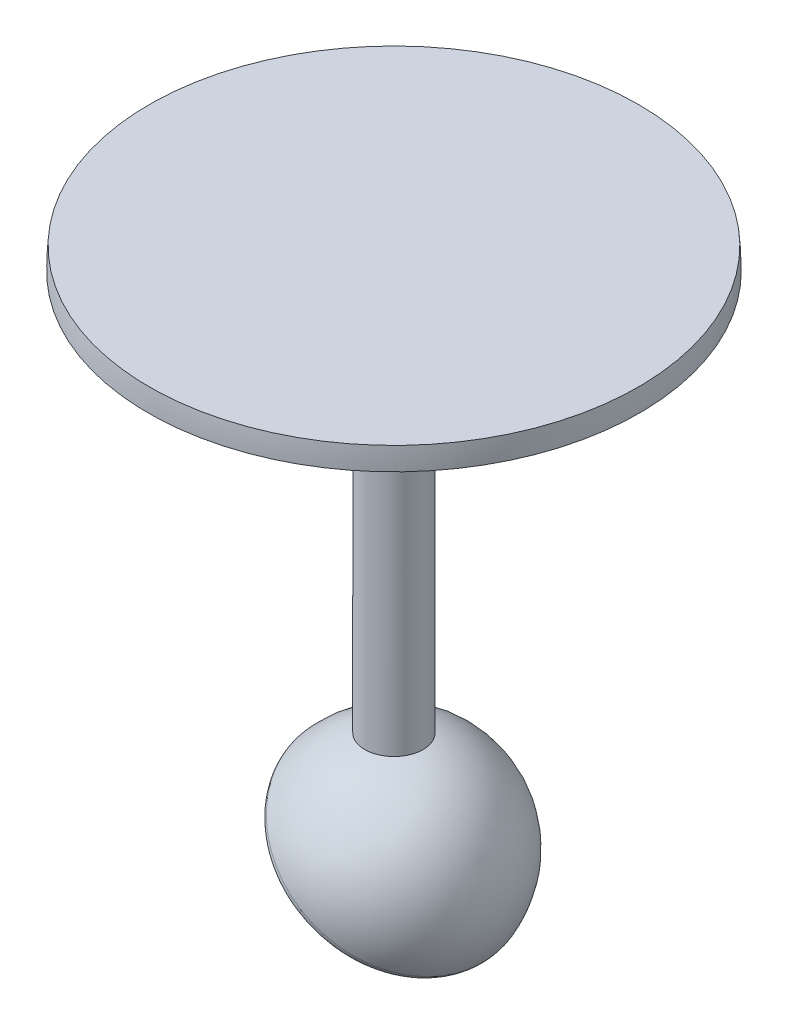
ISO-10303-21;
HEADER;
FILE_DESCRIPTION(('STEP AP214'),'2;1');
FILE_NAME('part.step','',(''),(''),'','','');
FILE_SCHEMA(('AUTOMOTIVE_DESIGN { 1 0 10303 214 1 1 1 1 }'));
ENDSEC;
DATA;
#1=APPLICATION_CONTEXT('core data for automotive mechanical design processes');
#2=APPLICATION_PROTOCOL_DEFINITION('international standard','automotive_design',2000,#1);
#3=PRODUCT_CONTEXT('',#1,'mechanical');
#4=PRODUCT('Part','Part','',(#3));
#5=PRODUCT_RELATED_PRODUCT_CATEGORY('part','',(#4));
#6=PRODUCT_DEFINITION_FORMATION('','',#4);
#7=PRODUCT_DEFINITION_CONTEXT('part definition',#1,'design');
#8=PRODUCT_DEFINITION('design','',#6,#7);
#9=PRODUCT_DEFINITION_SHAPE('','',#8);
#10=(LENGTH_UNIT() NAMED_UNIT(*) SI_UNIT(.MILLI.,.METRE.));
#11=(NAMED_UNIT(*) PLANE_ANGLE_UNIT() SI_UNIT($,.RADIAN.));
#12=(NAMED_UNIT(*) SI_UNIT($,.STERADIAN.) SOLID_ANGLE_UNIT());
#13=UNCERTAINTY_MEASURE_WITH_UNIT(LENGTH_MEASURE(1.E-05),#10,'distance_accuracy_value','');
#14=(GEOMETRIC_REPRESENTATION_CONTEXT(3) GLOBAL_UNCERTAINTY_ASSIGNED_CONTEXT((#13)) GLOBAL_UNIT_ASSIGNED_CONTEXT((#10,
#11,#12)) REPRESENTATION_CONTEXT('',''));
#15=CARTESIAN_POINT('',(0.,0.,0.));
#16=DIRECTION('',(0.,0.,1.));
#17=DIRECTION('',(1.,0.,0.));
#18=AXIS2_PLACEMENT_3D('',#15,#16,#17);
#19=CARTESIAN_POINT('',(0.,0.,0.));
#20=DIRECTION('',(-1.,0.,0.));
#21=DIRECTION('',(0.,-1.,0.));
#22=AXIS2_PLACEMENT_3D('',#19,#20,#21);
#23=SPHERICAL_SURFACE('',#22,12.5);
#24=CARTESIAN_POINT('',(0.648468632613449,0.872331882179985,0.));
#25=DIRECTION('',(-0.596591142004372,-0.802545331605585,0.));
#26=DIRECTION('',(0.802545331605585,-0.596591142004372,0.));
#27=AXIS2_PLACEMENT_3D('',#24,#25,#26);
#28=CIRCLE('',#27,12.4526513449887);
#29=CARTESIAN_POINT('',(10.6422858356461,-6.5568096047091,0.));
#30=VERTEX_POINT('',#29);
#31=EDGE_CURVE('E36',#30,#30,#28,.F.);
#32=ORIENTED_EDGE('',*,*,#31,.T.);
#33=EDGE_LOOP('',(#32));
#34=FACE_BOUND('',#33,.T.);
#35=CARTESIAN_POINT('',(0.,12.,0.));
#36=DIRECTION('',(0.,-1.,0.));
#37=DIRECTION('',(0.,0.,-1.));
#38=AXIS2_PLACEMENT_3D('',#35,#36,#37);
#39=CIRCLE('',#38,3.5);
#40=CARTESIAN_POINT('',(0.,12.,-3.5));
#41=VERTEX_POINT('',#40);
#42=EDGE_CURVE('E40',#41,#41,#39,.F.);
#43=ORIENTED_EDGE('',*,*,#42,.F.);
#44=EDGE_LOOP('',(#43));
#45=FACE_BOUND('',#44,.T.);
#46=ADVANCED_FACE('F30',(#34,#45),#23,.T.);
#47=CARTESIAN_POINT('',(0.,60.,0.));
#48=DIRECTION('',(0.,-1.,0.));
#49=DIRECTION('',(0.,0.,-1.));
#50=AXIS2_PLACEMENT_3D('',#47,#48,#49);
#51=CYLINDRICAL_SURFACE('',#50,3.5);
#52=CARTESIAN_POINT('',(0.,60.,0.));
#53=DIRECTION('',(0.,1.,0.));
#54=DIRECTION('',(0.,0.,1.));
#55=AXIS2_PLACEMENT_3D('',#52,#53,#54);
#56=CIRCLE('',#55,3.5);
#57=CARTESIAN_POINT('',(0.,60.,3.5));
#58=VERTEX_POINT('',#57);
#59=EDGE_CURVE('E44',#58,#58,#56,.T.);
#60=ORIENTED_EDGE('',*,*,#59,.F.);
#61=EDGE_LOOP('',(#60));
#62=FACE_BOUND('',#61,.T.);
#63=ORIENTED_EDGE('',*,*,#42,.T.);
#64=EDGE_LOOP('',(#63));
#65=FACE_BOUND('',#64,.T.);
#66=ADVANCED_FACE('F76',(#62,#65),#51,.T.);
#67=CARTESIAN_POINT('',(0.,60.,0.));
#68=DIRECTION('',(0.,-1.,0.));
#69=DIRECTION('',(0.,0.,-1.));
#70=AXIS2_PLACEMENT_3D('',#67,#68,#69);
#71=PLANE('',#70);
#72=CARTESIAN_POINT('',(0.,60.,0.));
#73=DIRECTION('',(0.,-1.,0.));
#74=DIRECTION('',(0.,0.,-1.));
#75=AXIS2_PLACEMENT_3D('',#72,#73,#74);
#76=CIRCLE('',#75,29.5);
#77=CARTESIAN_POINT('',(0.,60.,-29.5));
#78=VERTEX_POINT('',#77);
#79=EDGE_CURVE('E53',#78,#78,#76,.T.);
#80=ORIENTED_EDGE('',*,*,#79,.T.);
#81=EDGE_LOOP('',(#80));
#82=FACE_BOUND('',#81,.T.);
#83=ORIENTED_EDGE('',*,*,#59,.T.);
#84=EDGE_LOOP('',(#83));
#85=FACE_BOUND('',#84,.T.);
#86=ADVANCED_FACE('F72',(#82,#85),#71,.T.);
#87=CARTESIAN_POINT('',(0.,60.,0.));
#88=DIRECTION('',(0.,-1.,0.));
#89=DIRECTION('',(0.,0.,-1.));
#90=AXIS2_PLACEMENT_3D('',#87,#88,#89);
#91=SPHERICAL_SURFACE('',#90,29.5);
#92=CARTESIAN_POINT('',(0.,62.6638899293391,0.));
#93=DIRECTION('',(0.,-1.,0.));
#94=DIRECTION('',(0.,0.,-1.));
#95=AXIS2_PLACEMENT_3D('',#92,#93,#94);
#96=CIRCLE('',#95,29.3794773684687);
#97=CARTESIAN_POINT('',(0.,62.6638899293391,-29.3794773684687));
#98=VERTEX_POINT('',#97);
#99=EDGE_CURVE('E49',#98,#98,#96,.T.);
#100=ORIENTED_EDGE('',*,*,#99,.T.);
#101=EDGE_LOOP('',(#100));
#102=FACE_BOUND('',#101,.T.);
#103=ORIENTED_EDGE('',*,*,#79,.F.);
#104=EDGE_LOOP('',(#103));
#105=FACE_BOUND('',#104,.T.);
#106=ADVANCED_FACE('F59',(#102,#105),#91,.T.);
#107=CARTESIAN_POINT('',(0.,62.6638899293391,-29.3794773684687));
#108=DIRECTION('',(0.,1.,0.));
#109=DIRECTION('',(0.,0.,1.));
#110=AXIS2_PLACEMENT_3D('',#107,#108,#109);
#111=PLANE('',#110);
#112=ORIENTED_EDGE('',*,*,#99,.F.);
#113=EDGE_LOOP('',(#112));
#114=FACE_BOUND('',#113,.T.);
#115=ADVANCED_FACE('F62',(#114),#111,.T.);
#116=CARTESIAN_POINT('',(10.0318166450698,-7.45738927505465,-20.));
#117=DIRECTION('',(0.596591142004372,0.802545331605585,0.));
#118=DIRECTION('',(-0.802545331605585,0.596591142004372,0.));
#119=AXIS2_PLACEMENT_3D('',#116,#117,#118);
#120=PLANE('',#119);
#121=CARTESIAN_POINT('',(0.,0.,0.));
#122=DIRECTION('',(0.596591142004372,0.802545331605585,0.));
#123=DIRECTION('',(-0.802545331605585,0.596591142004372,0.));
#124=AXIS2_PLACEMENT_3D('',#121,#122,#123);
#125=CIRCLE('',#124,11.4564392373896);
#126=CARTESIAN_POINT('',(-9.19431182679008,6.83481016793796,0.));
#127=VERTEX_POINT('',#126);
#128=EDGE_CURVE('E10',#127,#127,#125,.F.);
#129=ORIENTED_EDGE('',*,*,#128,.T.);
#130=EDGE_LOOP('',(#129));
#131=FACE_BOUND('',#130,.T.);
#132=CARTESIAN_POINT('',(0.,0.,0.));
#133=DIRECTION('',(0.596591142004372,0.802545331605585,0.));
#134=DIRECTION('',(-0.802545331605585,0.596591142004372,0.));
#135=AXIS2_PLACEMENT_3D('',#132,#133,#134);
#136=CIRCLE('',#135,10.);
#137=CARTESIAN_POINT('',(-8.02545331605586,5.96591142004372,0.));
#138=VERTEX_POINT('',#137);
#139=EDGE_CURVE('E47',#138,#138,#136,.T.);
#140=ORIENTED_EDGE('',*,*,#139,.T.);
#141=EDGE_LOOP('',(#140));
#142=FACE_BOUND('',#141,.T.);
#143=ADVANCED_FACE('F64',(#131,#142),#120,.F.);
#144=CARTESIAN_POINT('',(0.,0.,0.));
#145=DIRECTION('',(-1.,0.,0.));
#146=DIRECTION('',(0.,1.,0.));
#147=AXIS2_PLACEMENT_3D('',#144,#145,#146);
#148=SPHERICAL_SURFACE('',#147,10.);
#149=CARTESIAN_POINT('',(0.,0.,0.));
#150=DIRECTION('',(0.596591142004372,0.802545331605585,0.));
#151=DIRECTION('',(-0.802545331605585,0.596591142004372,0.));
#152=AXIS2_PLACEMENT_3D('',#149,#150,#151);
#153=SPHERICAL_SURFACE('',#152,10.);
#154=ORIENTED_EDGE('',*,*,#139,.F.);
#155=EDGE_LOOP('',(#154));
#156=FACE_BOUND('',#155,.T.);
#157=ADVANCED_FACE('F70',(#156),#153,.F.);
#158=CARTESIAN_POINT('',(0.596591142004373,0.802545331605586,0.));
#159=DIRECTION('',(0.596591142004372,0.802545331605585,0.));
#160=DIRECTION('',(-0.802545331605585,0.596591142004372,0.));
#161=AXIS2_PLACEMENT_3D('',#158,#159,#160);
#162=TOROIDAL_SURFACE('',#161,11.4564392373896,1.);
#163=ORIENTED_EDGE('',*,*,#128,.F.);
#164=EDGE_LOOP('',(#163));
#165=FACE_BOUND('',#164,.T.);
#166=ORIENTED_EDGE('',*,*,#31,.F.);
#167=EDGE_LOOP('',(#166));
#168=FACE_BOUND('',#167,.T.);
#169=ADVANCED_FACE('F110',(#165,#168),#162,.T.);
#170=CLOSED_SHELL('',(#46,#66,#86,#106,#115,#143,#157,#169));
#171=MANIFOLD_SOLID_BREP('B2',#170);
#172=ADVANCED_BREP_SHAPE_REPRESENTATION('',(#18,#171),#14);
#173=SHAPE_DEFINITION_REPRESENTATION(#9,#172);
ENDSEC;
END-ISO-10303-21;
